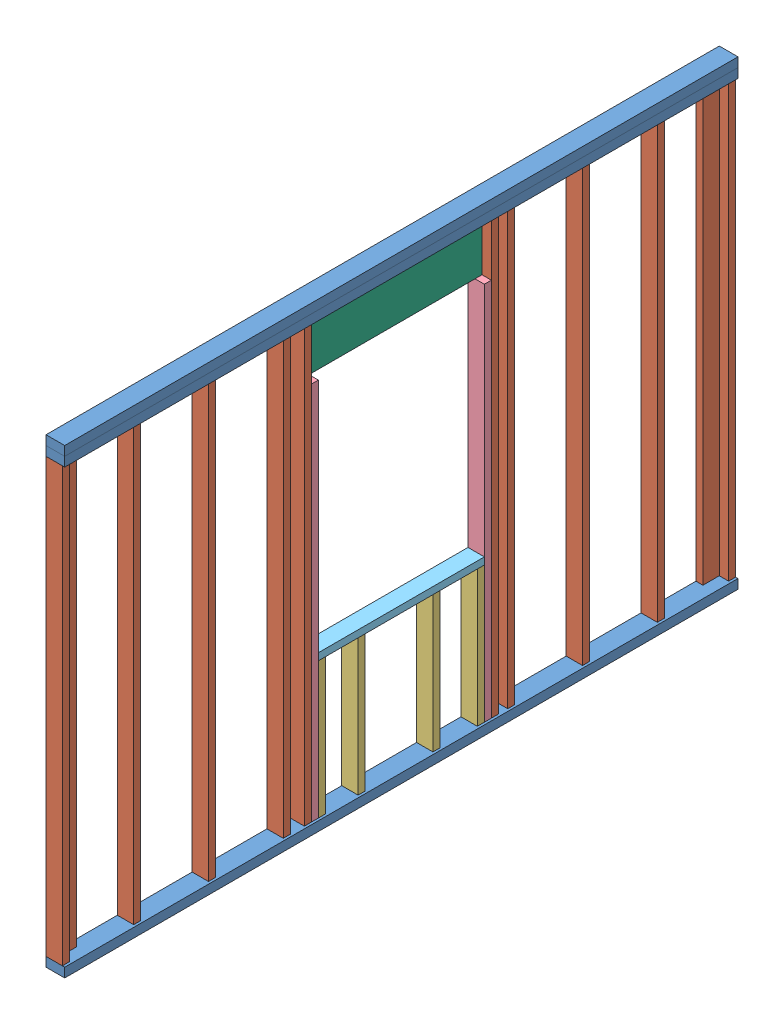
SolidWorks assembly DESN220-51C-MKrueger-Wall with window.SLDASM, configuration Default (file format 6000). Lengths in mm.
Overall size (101.6 2505.08 3657.6).
25 component instances, 6 part files, 23 mates.
Components (placement in the parent):
- DESN220-51C-MKrueger-2x4x144-5: DESN220-51C-MKrueger-2x4x144.SLDPRT [Default] at origin size (101.6 50.8 3657.6)
- DESN220-51C-MKrueger-2x4 STUD-1: DESN220-51C-MKrueger-2x4 STUD.SLDPRT [Default] at (-12.7 2403.475 0) x (1 0 0) z (0 -1 0) size (88.9 38.1 2352.68)
- DESN220-51C-MKrueger-2x4 STUD-2: DESN220-51C-MKrueger-2x4 STUD.SLDPRT [Default] at (-12.7 2403.475 387.35) x (1 0 0) z (0 -1 0) size (88.9 38.1 2352.68)
- DESN220-51C-MKrueger-2x4 STUD-4: DESN220-51C-MKrueger-2x4 STUD.SLDPRT [Default] at (-101.6 50.8 127) x (0 0 1) z (0 1 0) size (88.9 38.1 2352.68)
- DESN220-51C-MKrueger-2x4x29-125-1: DESN220-51C-MKrueger-2x4x29-125.SLDPRT [Default] at (-12.7 50.8 2266.95) x (1 0 0) z (0 1 0) size (88.9 38.1 739.77)
- DESN220-51C-MKrueger-2x4x29-125-2: DESN220-51C-MKrueger-2x4x29-125.SLDPRT [Default] at (-12.7 50.8 1403.35) x (1 0 0) z (0 1 0) size (88.9 38.1 739.77)
- DESN220-51C-MKrueger-2x4x29-125-3: DESN220-51C-MKrueger-2x4x29-125.SLDPRT [Default] at (-12.7 790.575 1606.55) x (1 0 0) z (0 -1 0) size (88.9 38.1 739.77)
- DESN220-51C-MKrueger-2x4x29-125-4: DESN220-51C-MKrueger-2x4x29-125.SLDPRT [Default] at (-12.7 790.575 2012.95) x (1 0 0) z (0 -1 0) size (88.9 38.1 739.77)
- DESN220-51C-MKrueger-2x4 STUD-6: DESN220-51C-MKrueger-2x4 STUD.SLDPRT [Default] at (-12.7 2403.475 2305.05) x (1 0 0) z (0 -1 0) size (88.9 38.1 2352.68)
- DESN220-51C-MKrueger-2x4x81-125-1: DESN220-51C-MKrueger-2x4x81-125.SLDPRT [Default] at (-12.7 50.8 2305.05) x (1 0 0) z (0 1 0) size (88.9 38.1 2060.57)
- DESN220-51C-MKrueger-2x4x35-500-1: DESN220-51C-MKrueger-2x4x35-500.SLDPRT [Default] at (-12.7 790.575 1365.25) size (88.9 38.1 901.7)
- DESN220-51C-MKrueger-2x4x81-125-2: DESN220-51C-MKrueger-2x4x81-125.SLDPRT [Default] at (-12.7 2111.375 1327.15) x (1 0 0) z (0 -1 0) size (88.9 38.1 2060.57)
- DESN220-51C-MKrueger-2x12x38-500-1: DESN220-51C-MKrueger-2x12x38-500.SLDPRT [Default] at (-101.6 2111.375 1327.15) x (0 -1 0) z (0 0 1) size (292.1 38.1 977.9)
- DESN220-51C-MKrueger-2x4 STUD-7: DESN220-51C-MKrueger-2x4 STUD.SLDPRT [Default] at (-12.7 2403.475 3619.5) x (1 0 0) z (0 -1 0) size (88.9 38.1 2352.68)
- DESN220-51C-MKrueger-2x4 STUD-8: DESN220-51C-MKrueger-2x4 STUD.SLDPRT [Default] at (-101.6 2403.475 3530.6) x (0 0 -1) z (0 -1 0) size (88.9 38.1 2352.68)
- DESN220-51C-MKrueger-2x4 STUD-9: DESN220-51C-MKrueger-2x4 STUD.SLDPRT [Default] at (-12.7 2403.475 793.75) x (1 0 0) z (0 -1 0) size (88.9 38.1 2352.68)
- DESN220-51C-MKrueger-2x4 STUD-10: DESN220-51C-MKrueger-2x4 STUD.SLDPRT [Default] at (-12.7 2403.475 1200.15) x (1 0 0) z (0 -1 0) size (88.9 38.1 2352.68)
- DESN220-51C-MKrueger-2x4 STUD-11: DESN220-51C-MKrueger-2x4 STUD.SLDPRT [Default] at (-12.7 2403.475 1606.55) x (1 0 0) z (0 -1 0) size (88.9 38.1 2352.68) (suppressed, hidden)
- DESN220-51C-MKrueger-2x4 STUD-12: DESN220-51C-MKrueger-2x4 STUD.SLDPRT [Default] at (-12.7 2403.475 2012.95) x (1 0 0) z (0 -1 0) size (88.9 38.1 2352.68) (suppressed, hidden)
- DESN220-51C-MKrueger-2x4 STUD-13: DESN220-51C-MKrueger-2x4 STUD.SLDPRT [Default] at (-12.7 2403.475 2419.35) x (1 0 0) z (0 -1 0) size (88.9 38.1 2352.68)
- DESN220-51C-MKrueger-2x4 STUD-14: DESN220-51C-MKrueger-2x4 STUD.SLDPRT [Default] at (-12.7 2403.475 2825.75) x (1 0 0) z (0 -1 0) size (88.9 38.1 2352.68)
- DESN220-51C-MKrueger-2x4 STUD-15: DESN220-51C-MKrueger-2x4 STUD.SLDPRT [Default] at (-12.7 2403.475 3232.15) x (1 0 0) z (0 -1 0) size (88.9 38.1 2352.68)
- DESN220-51C-MKrueger-2x4x144-6: DESN220-51C-MKrueger-2x4x144.SLDPRT [Default] at (0 2454.275 0) size (101.6 50.8 3657.6)
- DESN220-51C-MKrueger-2x4x144-7: DESN220-51C-MKrueger-2x4x144.SLDPRT [Default] at (0 2403.475 0) size (101.6 50.8 3657.6)
- DESN220-51C-MKrueger-2x4 STUD-16: DESN220-51C-MKrueger-2x4 STUD.SLDPRT [Default] at (-12.7 50.8 1327.15) x (1 0 0) z (0 1 0) size (88.9 38.1 2352.68)
Mates (geometry in assembly coordinates):
- Coincident55: coincident: point of DESN220-51C-MKrueger-2x4x144-5; point of assembly
- Coincident56: coincident aligned: line of DESN220-51C-MKrueger-2x4 STUD-7 through (-101.6 2403.475 3619.5) axis (0 -1 0); line of DESN220-51C-MKrueger-2x4 STUD-8 through (-101.6 2403.475 3619.5) axis (0 -1 0)
- Coincident57: coincident aligned: line of DESN220-51C-MKrueger-2x4x144-5 through (-101.6 50.8 3657.6) axis (1 0 0); line of DESN220-51C-MKrueger-2x4 STUD-7 through (-101.6 50.8 3657.6) axis (1 0 0)
- Coincident58: coincident: line of DESN220-51C-MKrueger-2x4x144-5 through (-101.6 50.8 0) axis (0 0 1); plane of DESN220-51C-MKrueger-2x4 STUD-7 through (-101.6 50.8 3657.6) normal (-1 0 0)
- Coincident59: coincident aligned: plane of DESN220-51C-MKrueger-2x4x144-5 through (-101.6 50.8 3657.6) normal (-1 0 0); plane of DESN220-51C-MKrueger-2x4 STUD-15 through (-101.6 50.8 3270.25) normal (-1 0 0)
- Coincident60: coincident aligned: plane of DESN220-51C-MKrueger-2x4x144-5 through (-101.6 50.8 3657.6) normal (-1 0 0); plane of DESN220-51C-MKrueger-2x4x29-125-4 through (-101.6 50.8 2051.05) normal (-1 0 0)
- Coincident61: coincident aligned: plane of DESN220-51C-MKrueger-2x4x144-5 through (-101.6 50.8 3657.6) normal (-1 0 0); plane of DESN220-51C-MKrueger-2x4x29-125-1 through (-101.6 790.575 2228.85) normal (-1 0 0)
- Coincident62: coincident aligned: plane of DESN220-51C-MKrueger-2x4x144-5 through (-101.6 50.8 3657.6) normal (-1 0 0); plane of DESN220-51C-MKrueger-2x4x81-125-1 through (-101.6 2111.375 2266.95) normal (-1 0 0)
- Coincident63: coincident aligned: plane of DESN220-51C-MKrueger-2x4x144-5 through (-101.6 50.8 3657.6) normal (-1 0 0); plane of DESN220-51C-MKrueger-2x4 STUD-6 through (-101.6 50.8 2343.15) normal (-1 0 0)
- Coincident64: coincident aligned: plane of DESN220-51C-MKrueger-2x4x144-5 through (-101.6 50.8 3657.6) normal (-1 0 0); plane of DESN220-51C-MKrueger-2x4x29-125-3 through (-101.6 50.8 1644.65) normal (-1 0 0)
- Coincident65: coincident aligned: plane of DESN220-51C-MKrueger-2x4x144-5 through (-101.6 50.8 3657.6) normal (-1 0 0); plane of DESN220-51C-MKrueger-2x4x29-125-2 through (-101.6 790.575 1365.25) normal (-1 0 0)
- Coincident66: coincident aligned: plane of DESN220-51C-MKrueger-2x4x144-5 through (-101.6 50.8 3657.6) normal (-1 0 0); plane of DESN220-51C-MKrueger-2x4x81-125-2 through (-101.6 50.8 1365.25) normal (-1 0 0)
- Coincident67: coincident aligned: plane of DESN220-51C-MKrueger-2x4x29-125-3 through (-101.6 50.8 1644.65) normal (-1 0 0); plane of DESN220-51C-MKrueger-2x4x35-500-1 through (-101.6 828.675 2266.95) normal (-1 0 0)
- Coincident68: coincident: line of DESN220-51C-MKrueger-2x4x81-125-1 through (-101.6 50.8 2266.95) axis (0 1 0); plane of DESN220-51C-MKrueger-2x12x38-500-1 through (-101.6 2111.375 1327.15) normal (-1 0 0)
- Coincident69: coincident aligned: plane of DESN220-51C-MKrueger-2x4x144-5 through (-101.6 50.8 3657.6) normal (-1 0 0); plane of DESN220-51C-MKrueger-2x4 STUD-1 through (-101.6 50.8 38.1) normal (-1 0 0)
- Coincident70: coincident aligned: plane of DESN220-51C-MKrueger-2x4 STUD-1 through (-12.7 2403.475 0) normal (0 0 -1); plane of DESN220-51C-MKrueger-2x4x144-7 through (-101.6 2454.275 0) normal (0 0 -1)
- Coincident71: coincident aligned: plane of DESN220-51C-MKrueger-2x4 STUD-4 through (-101.6 50.8 127) normal (-1 0 0); plane of DESN220-51C-MKrueger-2x4x144-7 through (-101.6 2454.275 3657.6) normal (-1 0 0)
- Coincident72: coincident aligned: line of DESN220-51C-MKrueger-2x4 STUD-1 through (-12.7 2403.475 0) axis (-1 0 0); line of DESN220-51C-MKrueger-2x4x144-7 through (0 2403.475 0) axis (-1 0 0)
- Coincident73: coincident aligned: plane of DESN220-51C-MKrueger-2x4x144-6 through (-101.6 2505.075 0) normal (0 0 -1); plane of DESN220-51C-MKrueger-2x4x144-7 through (-101.6 2454.275 0) normal (0 0 -1)
- Coincident74: coincident aligned: line of DESN220-51C-MKrueger-2x4x144-6 through (0 2454.275 0) axis (-1 0 0); line of DESN220-51C-MKrueger-2x4x144-7 through (0 2454.275 0) axis (-1 0 0)
- Coincident75: coincident aligned: line of DESN220-51C-MKrueger-2x4x144-6 through (0 2454.275 3657.6) axis (0 0 -1); line of DESN220-51C-MKrueger-2x4x144-7 through (0 2454.275 3657.6) axis (0 0 -1)
- Coincident76: coincident anti-aligned: line of DESN220-51C-MKrueger-2x4x81-125-2 through (-12.7 50.8 1327.15) axis (0 1 0); line of DESN220-51C-MKrueger-2x4 STUD-16 through (-12.7 2403.475 1327.15) axis (0 -1 0)
- Coincident77: coincident anti-aligned: plane of DESN220-51C-MKrueger-2x4x144-5 through (0 50.8 0) normal (0 1 0); plane of DESN220-51C-MKrueger-2x4 STUD-16 through (-101.6 50.8 1289.05) normal (0 -1 0)
